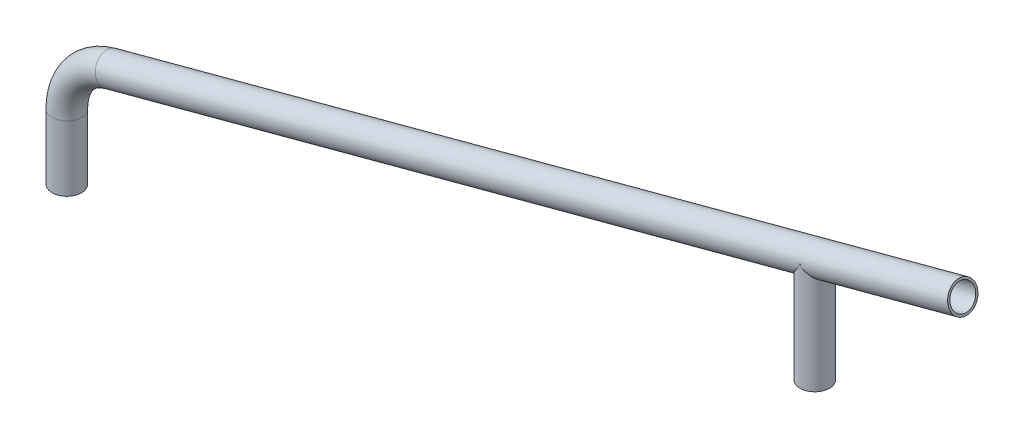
ISO-10303-21;
HEADER;
FILE_DESCRIPTION(('STEP AP214'),'2;1');
FILE_NAME('part.step','',(''),(''),'','','');
FILE_SCHEMA(('AUTOMOTIVE_DESIGN { 1 0 10303 214 1 1 1 1 }'));
ENDSEC;
DATA;
#1=APPLICATION_CONTEXT('core data for automotive mechanical design processes');
#2=APPLICATION_PROTOCOL_DEFINITION('international standard','automotive_design',2000,#1);
#3=PRODUCT_CONTEXT('',#1,'mechanical');
#4=PRODUCT('Part','Part','',(#3));
#5=PRODUCT_RELATED_PRODUCT_CATEGORY('part','',(#4));
#6=PRODUCT_DEFINITION_FORMATION('','',#4);
#7=PRODUCT_DEFINITION_CONTEXT('part definition',#1,'design');
#8=PRODUCT_DEFINITION('design','',#6,#7);
#9=PRODUCT_DEFINITION_SHAPE('','',#8);
#10=(LENGTH_UNIT() NAMED_UNIT(*) SI_UNIT(.MILLI.,.METRE.));
#11=(NAMED_UNIT(*) PLANE_ANGLE_UNIT() SI_UNIT($,.RADIAN.));
#12=(NAMED_UNIT(*) SI_UNIT($,.STERADIAN.) SOLID_ANGLE_UNIT());
#13=UNCERTAINTY_MEASURE_WITH_UNIT(LENGTH_MEASURE(1.E-05),#10,'distance_accuracy_value','');
#14=(GEOMETRIC_REPRESENTATION_CONTEXT(3) GLOBAL_UNCERTAINTY_ASSIGNED_CONTEXT((#13)) GLOBAL_UNIT_ASSIGNED_CONTEXT((#10,
#11,#12)) REPRESENTATION_CONTEXT('',''));
#15=CARTESIAN_POINT('',(0.,0.,0.));
#16=DIRECTION('',(0.,0.,1.));
#17=DIRECTION('',(1.,0.,0.));
#18=AXIS2_PLACEMENT_3D('',#15,#16,#17);
#19=CARTESIAN_POINT('',(29.6472381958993,82.9439535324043,0.));
#20=DIRECTION('',(0.965925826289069,0.258819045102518,0.));
#21=DIRECTION('',(-0.258819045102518,0.965925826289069,0.));
#22=AXIS2_PLACEMENT_3D('',#19,#20,#21);
#23=CYLINDRICAL_SURFACE('',#22,10.);
#24=CARTESIAN_POINT('',(29.6472381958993,82.9439535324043,0.));
#25=DIRECTION('',(0.965925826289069,0.258819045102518,0.));
#26=DIRECTION('',(0.,0.,1.));
#27=AXIS2_PLACEMENT_3D('',#24,#25,#26);
#28=CIRCLE('',#27,10.);
#29=CARTESIAN_POINT('',(27.0590477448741,92.6032117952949,0.));
#30=VERTEX_POINT('',#29);
#31=EDGE_CURVE('E283',#30,#30,#28,.T.);
#32=ORIENTED_EDGE('',*,*,#31,.T.);
#33=EDGE_LOOP('',(#32));
#34=FACE_BOUND('',#33,.T.);
#35=CARTESIAN_POINT('',(608.533270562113,238.055998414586,0.));
#36=DIRECTION('',(0.965925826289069,0.258819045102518,0.));
#37=DIRECTION('',(0.,0.,1.));
#38=AXIS2_PLACEMENT_3D('',#35,#36,#37);
#39=CIRCLE('',#38,10.);
#40=CARTESIAN_POINT('',(608.533270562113,238.055998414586,10.));
#41=VERTEX_POINT('',#40);
#42=EDGE_CURVE('E288',#41,#41,#39,.T.);
#43=ORIENTED_EDGE('',*,*,#42,.F.);
#44=EDGE_LOOP('',(#43));
#45=FACE_BOUND('',#44,.T.);
#46=CARTESIAN_POINT('',(507.995718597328,211.11704255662,0.));
#47=DIRECTION('',(0.608761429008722,0.793353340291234,0.));
#48=DIRECTION('',(0.793353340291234,-0.608761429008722,0.));
#49=AXIS2_PLACEMENT_3D('',#46,#47,#48);
#50=ELLIPSE('',#49,12.6047241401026,9.99999999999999);
#51=CARTESIAN_POINT('',(506.845026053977,212.,-9.93357471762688));
#52=VERTEX_POINT('',#51);
#53=CARTESIAN_POINT('',(507.995718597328,211.11704255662,-10.));
#54=VERTEX_POINT('',#53);
#55=EDGE_CURVE('E225',#52,#54,#50,.F.);
#56=ORIENTED_EDGE('',*,*,#55,.T.);
#57=CARTESIAN_POINT('',(507.995718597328,211.11704255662,0.));
#58=DIRECTION('',(0.793353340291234,-0.608761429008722,0.));
#59=DIRECTION('',(0.608761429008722,0.793353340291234,0.));
#60=AXIS2_PLACEMENT_3D('',#57,#58,#59);
#61=ELLIPSE('',#60,16.4267963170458,9.99999999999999);
#62=CARTESIAN_POINT('',(507.995718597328,211.11704255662,9.99999999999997));
#63=VERTEX_POINT('',#62);
#64=EDGE_CURVE('E265',#54,#63,#61,.F.);
#65=ORIENTED_EDGE('',*,*,#64,.T.);
#66=CARTESIAN_POINT('',(506.845026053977,212.,9.93357471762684));
#67=VERTEX_POINT('',#66);
#68=EDGE_CURVE('E49',#63,#67,#50,.F.);
#69=ORIENTED_EDGE('',*,*,#68,.T.);
#70=CARTESIAN_POINT('',(511.290960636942,212.,0.));
#71=DIRECTION('',(0.,1.,0.));
#72=DIRECTION('',(1.,0.,0.));
#73=AXIS2_PLACEMENT_3D('',#70,#71,#72);
#74=ELLIPSE('',#73,38.6370330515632,10.);
#75=CARTESIAN_POINT('',(508.67323567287,212.,9.97702213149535));
#76=VERTEX_POINT('',#75);
#77=EDGE_CURVE('E262',#76,#67,#74,.F.);
#78=ORIENTED_EDGE('',*,*,#77,.F.);
#79=CARTESIAN_POINT('',(507.995718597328,211.11704255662,0.));
#80=DIRECTION('',(0.793353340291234,-0.608761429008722,0.));
#81=DIRECTION('',(0.608761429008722,0.793353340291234,0.));
#82=AXIS2_PLACEMENT_3D('',#79,#80,#81);
#83=ELLIPSE('',#82,16.4267963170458,9.99999999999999);
#84=EDGE_CURVE('E267',#76,#63,#83,.T.);
#85=ORIENTED_EDGE('',*,*,#84,.T.);
#86=CARTESIAN_POINT('',(507.995718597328,211.11704255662,0.));
#87=DIRECTION('',(0.608761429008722,0.793353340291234,0.));
#88=DIRECTION('',(0.793353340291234,-0.608761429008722,0.));
#89=AXIS2_PLACEMENT_3D('',#86,#87,#88);
#90=ELLIPSE('',#89,12.6047241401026,9.99999999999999);
#91=EDGE_CURVE('E440',#63,#54,#90,.T.);
#92=ORIENTED_EDGE('',*,*,#91,.T.);
#93=CARTESIAN_POINT('',(508.67323567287,212.,-9.97702213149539));
#94=VERTEX_POINT('',#93);
#95=EDGE_CURVE('E261',#54,#94,#83,.T.);
#96=ORIENTED_EDGE('',*,*,#95,.T.);
#97=EDGE_CURVE('E254',#52,#94,#74,.F.);
#98=ORIENTED_EDGE('',*,*,#97,.F.);
#99=EDGE_LOOP('',(#56,#65,#69,#78,#85,#92,#96,#98));
#100=FACE_BOUND('',#99,.T.);
#101=ADVANCED_FACE('F32',(#34,#45,#100),#23,.T.);
#102=CARTESIAN_POINT('',(29.6472381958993,82.9439535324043,0.));
#103=DIRECTION('',(0.965925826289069,0.258819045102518,0.));
#104=DIRECTION('',(-0.258819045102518,0.965925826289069,0.));
#105=AXIS2_PLACEMENT_3D('',#102,#103,#104);
#106=CYLINDRICAL_SURFACE('',#105,8.50000000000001);
#107=CARTESIAN_POINT('',(507.995718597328,211.11704255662,0.));
#108=DIRECTION('',(0.608761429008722,0.793353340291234,0.));
#109=DIRECTION('',(0.793353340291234,-0.608761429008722,0.));
#110=AXIS2_PLACEMENT_3D('',#107,#108,#109);
#111=ELLIPSE('',#110,10.7140155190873,8.50000000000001);
#112=CARTESIAN_POINT('',(506.845026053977,212.,-8.42175199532));
#113=VERTEX_POINT('',#112);
#114=CARTESIAN_POINT('',(507.995718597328,211.11704255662,-8.50000000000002));
#115=VERTEX_POINT('',#114);
#116=EDGE_CURVE('E57',#113,#115,#111,.F.);
#117=ORIENTED_EDGE('',*,*,#116,.T.);
#118=CARTESIAN_POINT('',(507.995718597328,211.11704255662,0.));
#119=DIRECTION('',(0.793353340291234,-0.608761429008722,0.));
#120=DIRECTION('',(0.608761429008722,0.793353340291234,0.));
#121=AXIS2_PLACEMENT_3D('',#118,#119,#120);
#122=ELLIPSE('',#121,13.9627768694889,8.50000000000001);
#123=CARTESIAN_POINT('',(508.67323567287,212.,-8.47295524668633));
#124=VERTEX_POINT('',#123);
#125=EDGE_CURVE('E114',#115,#124,#122,.T.);
#126=ORIENTED_EDGE('',*,*,#125,.T.);
#127=CARTESIAN_POINT('',(511.290960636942,212.,0.));
#128=DIRECTION('',(0.,1.,0.));
#129=DIRECTION('',(1.,0.,0.));
#130=AXIS2_PLACEMENT_3D('',#127,#128,#129);
#131=ELLIPSE('',#130,32.8414780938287,8.50000000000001);
#132=CARTESIAN_POINT('',(513.288863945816,212.,-8.48425673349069));
#133=VERTEX_POINT('',#132);
#134=EDGE_CURVE('E121',#124,#133,#131,.F.);
#135=ORIENTED_EDGE('',*,*,#134,.T.);
#136=CARTESIAN_POINT('',(513.288863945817,212.,8.48425673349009));
#137=CARTESIAN_POINT('',(513.302468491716,211.858403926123,8.47574168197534));
#138=CARTESIAN_POINT('',(513.321866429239,211.717625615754,8.46362143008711));
#139=CARTESIAN_POINT('',(513.371421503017,211.439011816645,8.43224760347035));
#140=CARTESIAN_POINT('',(513.401561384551,211.301171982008,8.41300546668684));
#141=CARTESIAN_POINT('',(513.471336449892,211.031159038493,8.36775184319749));
#142=CARTESIAN_POINT('',(513.510834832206,210.898933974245,8.34183745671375));
#143=CARTESIAN_POINT('',(513.598300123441,210.638796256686,8.28334815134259));
#144=CARTESIAN_POINT('',(513.646270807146,210.510885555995,8.25077026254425));
#145=CARTESIAN_POINT('',(513.766734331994,210.217340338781,8.16715360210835));
#146=CARTESIAN_POINT('',(513.842034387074,210.053573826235,8.113597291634));
#147=CARTESIAN_POINT('',(514.002093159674,209.734749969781,7.99583260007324));
#148=CARTESIAN_POINT('',(514.086855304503,209.579695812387,7.93162035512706));
#149=CARTESIAN_POINT('',(514.263545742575,209.277086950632,7.79275603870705));
#150=CARTESIAN_POINT('',(514.355517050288,209.129587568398,7.71803879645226));
#151=CARTESIAN_POINT('',(514.543756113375,208.842713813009,7.55899529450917));
#152=CARTESIAN_POINT('',(514.640025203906,208.703341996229,7.47466603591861));
#153=CARTESIAN_POINT('',(514.874487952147,208.37719345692,7.26064051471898));
#154=CARTESIAN_POINT('',(515.013816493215,208.194176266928,7.12643715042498));
#155=CARTESIAN_POINT('',(515.292705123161,207.842433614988,6.84060828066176));
#156=CARTESIAN_POINT('',(515.43226527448,207.6737130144,6.6889768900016));
#157=CARTESIAN_POINT('',(515.70803291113,207.350289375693,6.36904787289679));
#158=CARTESIAN_POINT('',(515.84424333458,207.195573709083,6.20076555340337));
#159=CARTESIAN_POINT('',(516.110513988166,206.899995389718,5.84798585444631));
#160=CARTESIAN_POINT('',(516.240574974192,206.759131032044,5.66349047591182));
#161=CARTESIAN_POINT('',(516.492845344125,206.490663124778,5.27753340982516));
#162=CARTESIAN_POINT('',(516.614993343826,206.363159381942,5.07596192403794));
#163=CARTESIAN_POINT('',(516.847963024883,206.123240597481,4.65779468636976));
#164=CARTESIAN_POINT('',(516.958784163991,206.010826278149,4.44119821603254));
#165=CARTESIAN_POINT('',(517.166664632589,205.802110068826,3.99429959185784));
#166=CARTESIAN_POINT('',(517.263735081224,205.705795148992,3.76400872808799));
#167=CARTESIAN_POINT('',(517.442013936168,205.530245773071,3.29109814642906));
#168=CARTESIAN_POINT('',(517.523224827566,205.451008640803,3.04848036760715));
#169=CARTESIAN_POINT('',(517.660738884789,205.317561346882,2.57713600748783));
#170=CARTESIAN_POINT('',(517.71870118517,205.261661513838,2.3493712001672));
#171=CARTESIAN_POINT('',(517.818877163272,205.165375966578,1.88717999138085));
#172=CARTESIAN_POINT('',(517.861091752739,205.124989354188,1.65275397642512));
#173=CARTESIAN_POINT('',(517.928790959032,205.060347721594,1.17948103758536));
#174=CARTESIAN_POINT('',(517.954288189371,205.036080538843,0.940637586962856));
#175=CARTESIAN_POINT('',(517.987998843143,205.004015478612,0.460644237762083));
#176=CARTESIAN_POINT('',(517.996214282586,204.996215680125,0.219494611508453));
#177=CARTESIAN_POINT('',(517.995244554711,204.997137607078,-0.230968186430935));
#178=CARTESIAN_POINT('',(517.988206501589,205.003820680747,-0.440295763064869));
#179=CARTESIAN_POINT('',(517.961090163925,205.029608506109,-0.8573349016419));
#180=CARTESIAN_POINT('',(517.941012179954,205.048712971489,-1.06504650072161));
#181=CARTESIAN_POINT('',(517.888175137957,205.099113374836,-1.47732838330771));
#182=CARTESIAN_POINT('',(517.855416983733,205.130408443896,-1.68189888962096));
#183=CARTESIAN_POINT('',(517.777784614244,205.204836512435,-2.08653462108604));
#184=CARTESIAN_POINT('',(517.732910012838,205.247969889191,-2.28659970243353));
#185=CARTESIAN_POINT('',(517.632269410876,205.345158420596,-2.67909417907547));
#186=CARTESIAN_POINT('',(517.576611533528,205.399105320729,-2.87157825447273));
#187=CARTESIAN_POINT('',(517.454966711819,205.517702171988,-3.24994351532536));
#188=CARTESIAN_POINT('',(517.388975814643,205.582356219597,-3.43582214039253));
#189=CARTESIAN_POINT('',(517.247661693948,205.721812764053,-3.79995737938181));
#190=CARTESIAN_POINT('',(517.172342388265,205.796611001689,-3.97821715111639));
#191=CARTESIAN_POINT('',(517.013365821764,205.955887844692,-4.32651055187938));
#192=CARTESIAN_POINT('',(516.929707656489,206.040367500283,-4.49654328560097));
#193=CARTESIAN_POINT('',(516.745897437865,206.22797965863,-4.84532998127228));
#194=CARTESIAN_POINT('',(516.644936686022,206.332139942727,-5.02310527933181));
#195=CARTESIAN_POINT('',(516.435656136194,206.551244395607,-5.36731145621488));
#196=CARTESIAN_POINT('',(516.327335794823,206.666189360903,-5.53374149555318));
#197=CARTESIAN_POINT('',(516.104687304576,206.906784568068,-5.85516254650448));
#198=CARTESIAN_POINT('',(515.990346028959,207.032458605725,-6.01012662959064));
#199=CARTESIAN_POINT('',(515.757617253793,207.294126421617,-6.30782310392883));
#200=CARTESIAN_POINT('',(515.63922950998,207.430120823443,-6.45055475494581));
#201=CARTESIAN_POINT('',(515.38271084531,207.733314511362,-6.74356063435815));
#202=CARTESIAN_POINT('',(515.244242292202,207.9021584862,-6.89184479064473));
#203=CARTESIAN_POINT('',(514.96786856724,208.254098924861,-7.17131419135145));
#204=CARTESIAN_POINT('',(514.829963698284,208.437202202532,-7.30249117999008));
#205=CARTESIAN_POINT('',(514.5594927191,208.81800358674,-7.54651825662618));
#206=CARTESIAN_POINT('',(514.426912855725,209.01565978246,-7.65941819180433));
#207=CARTESIAN_POINT('',(514.172444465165,209.427118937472,-7.86605604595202));
#208=CARTESIAN_POINT('',(514.050543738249,209.640902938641,-7.95981599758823));
#209=CARTESIAN_POINT('',(513.876039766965,209.984653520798,-8.08874269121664));
#210=CARTESIAN_POINT('',(513.817071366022,210.108688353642,-8.13120441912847));
#211=CARTESIAN_POINT('',(513.706001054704,210.361774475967,-8.20958469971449));
#212=CARTESIAN_POINT('',(513.653896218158,210.490823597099,-8.24550604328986));
#213=CARTESIAN_POINT('',(513.558179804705,210.753236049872,-8.31037702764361));
#214=CARTESIAN_POINT('',(513.51454014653,210.886583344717,-8.33934979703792));
#215=CARTESIAN_POINT('',(513.436938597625,211.157340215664,-8.39018962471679));
#216=CARTESIAN_POINT('',(513.40297103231,211.294747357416,-8.41206085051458));
#217=CARTESIAN_POINT('',(513.355195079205,211.526861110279,-8.44254298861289));
#218=CARTESIAN_POINT('',(513.338432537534,211.620710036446,-8.45314838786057));
#219=CARTESIAN_POINT('',(513.309871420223,211.809584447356,-8.47112975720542));
#220=CARTESIAN_POINT('',(513.29807894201,211.904611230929,-8.47850176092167));
#221=CARTESIAN_POINT('',(513.288863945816,212.,-8.48425673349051));
#222=B_SPLINE_CURVE_WITH_KNOTS('',3,(#136,#137,#138,#139,#140,#141,#142,#143,#144,#145,#146,
#147,#148,#149,#150,#151,#152,#153,#154,#155,#156,#157,#158,#159,#160,#161,#162,#163,#164,#165,
#166,#167,#168,#169,#170,#171,#172,#173,#174,#175,#176,#177,#178,#179,#180,#181,#182,#183,#184,
#185,#186,#187,#188,#189,#190,#191,#192,#193,#194,#195,#196,#197,#198,#199,#200,#201,#202,#203,
#204,#205,#206,#207,#208,#209,#210,#211,#212,#213,#214,#215,#216,#217,#218,#219,#220,#221),
.UNSPECIFIED.,.F.,.F.,(4,2,2,2,2,2,2,2,2,2,2,2,2,2,2,2,2,2,2,2,2,2,2,2,2,2,2,2,2,2,2,2,2,2,2,2,
2,2,2,2,2,2,4),(0.,0.427282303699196,0.853881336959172,1.27459220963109,1.69549100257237,
2.25870213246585,2.82211793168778,3.38919739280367,3.95645426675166,4.75429687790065,
5.55240970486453,6.34979553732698,7.14708309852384,7.94995579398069,8.75286690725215,
9.55512501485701,10.3572573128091,11.0809474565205,11.8045956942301,12.5276972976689,
13.2507145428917,13.8786076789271,14.5064863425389,15.1343202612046,15.7621741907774,
16.3840311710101,17.0061266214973,17.6279616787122,18.2498642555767,18.9375204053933,
19.6252273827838,20.3145013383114,21.0038169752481,21.7947527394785,22.5860688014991,
23.3751889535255,24.1633955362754,24.5943248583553,25.0250698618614,25.4543605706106,
25.8833988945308,26.1709868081,26.4589265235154),.UNSPECIFIED.);
#223=CARTESIAN_POINT('',(513.288863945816,212.,8.48425673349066));
#224=VERTEX_POINT('',#223);
#225=EDGE_CURVE('E128',#224,#133,#222,.T.);
#226=ORIENTED_EDGE('',*,*,#225,.F.);
#227=CARTESIAN_POINT('',(508.67323567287,212.,8.47295524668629));
#228=VERTEX_POINT('',#227);
#229=EDGE_CURVE('E118',#224,#228,#131,.F.);
#230=ORIENTED_EDGE('',*,*,#229,.T.);
#231=CARTESIAN_POINT('',(507.995718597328,211.11704255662,8.49999999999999));
#232=VERTEX_POINT('',#231);
#233=EDGE_CURVE('E101',#228,#232,#122,.T.);
#234=ORIENTED_EDGE('',*,*,#233,.T.);
#235=CARTESIAN_POINT('',(506.845026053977,212.,8.42175199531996));
#236=VERTEX_POINT('',#235);
#237=EDGE_CURVE('E134',#232,#236,#111,.F.);
#238=ORIENTED_EDGE('',*,*,#237,.T.);
#239=CARTESIAN_POINT('',(502.229397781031,212.,8.17003942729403));
#240=VERTEX_POINT('',#239);
#241=EDGE_CURVE('E132',#236,#240,#131,.F.);
#242=ORIENTED_EDGE('',*,*,#241,.T.);
#243=CARTESIAN_POINT('',(502.22939778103,212.,-8.17003942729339));
#244=CARTESIAN_POINT('',(502.288975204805,211.864449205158,-8.21208459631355));
#245=CARTESIAN_POINT('',(502.34458119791,211.725854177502,-8.25035622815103));
#246=CARTESIAN_POINT('',(502.44618439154,211.443118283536,-8.31904194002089));
#247=CARTESIAN_POINT('',(502.492169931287,211.298970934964,-8.34944649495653));
#248=CARTESIAN_POINT('',(502.572207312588,211.007847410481,-8.40165379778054));
#249=CARTESIAN_POINT('',(502.606402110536,210.860929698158,-8.42356002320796));
#250=CARTESIAN_POINT('',(502.662441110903,210.563862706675,-8.45915239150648));
#251=CARTESIAN_POINT('',(502.684292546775,210.413715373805,-8.47284334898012));
#252=CARTESIAN_POINT('',(502.715268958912,210.110608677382,-8.49218448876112));
#253=CARTESIAN_POINT('',(502.724310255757,209.957637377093,-8.49778180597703));
#254=CARTESIAN_POINT('',(502.72972971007,209.651400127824,-8.50113756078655));
#255=CARTESIAN_POINT('',(502.726104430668,209.498134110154,-8.49889387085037));
#256=CARTESIAN_POINT('',(502.697595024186,209.039498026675,-8.481189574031));
#257=CARTESIAN_POINT('',(502.655054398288,208.735543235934,-8.45474145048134));
#258=CARTESIAN_POINT('',(502.550386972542,208.21560827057,-8.38754941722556));
#259=CARTESIAN_POINT('',(502.496119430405,207.997120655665,-8.35223705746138));
#260=CARTESIAN_POINT('',(502.372991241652,207.566433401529,-8.26985224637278));
#261=CARTESIAN_POINT('',(502.304121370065,207.354237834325,-8.22277235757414));
#262=CARTESIAN_POINT('',(502.155325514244,206.935440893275,-8.11776617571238));
#263=CARTESIAN_POINT('',(502.075349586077,206.728870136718,-8.05979044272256));
#264=CARTESIAN_POINT('',(501.907631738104,206.322084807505,-7.93386416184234));
#265=CARTESIAN_POINT('',(501.819890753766,206.121869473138,-7.86591481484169));
#266=CARTESIAN_POINT('',(501.65371274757,205.75967474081,-7.73229645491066));
#267=CARTESIAN_POINT('',(501.576092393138,205.596785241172,-7.66806317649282));
#268=CARTESIAN_POINT('',(501.418096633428,205.275133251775,-7.53297429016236));
#269=CARTESIAN_POINT('',(501.337720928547,205.116371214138,-7.4621179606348));
#270=CARTESIAN_POINT('',(501.093754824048,204.64601199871,-7.23956630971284));
#271=CARTESIAN_POINT('',(500.927387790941,204.340474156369,-7.07793728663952));
#272=CARTESIAN_POINT('',(500.59355528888,203.746898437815,-6.72803243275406));
#273=CARTESIAN_POINT('',(500.426093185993,203.458822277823,-6.53981814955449));
#274=CARTESIAN_POINT('',(500.094570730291,202.901302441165,-6.13516406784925));
#275=CARTESIAN_POINT('',(499.930507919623,202.631844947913,-5.9187455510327));
#276=CARTESIAN_POINT('',(499.67066817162,202.211963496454,-5.54295372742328));
#277=CARTESIAN_POINT('',(499.572407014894,202.054872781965,-5.3927215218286));
#278=CARTESIAN_POINT('',(499.380291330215,201.750322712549,-5.08016625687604));
#279=CARTESIAN_POINT('',(499.286437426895,201.602864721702,-4.91784149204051));
#280=CARTESIAN_POINT('',(499.013795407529,201.17744429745,-4.41262795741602));
#281=CARTESIAN_POINT('',(498.843441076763,200.915658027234,-4.05081941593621));
#282=CARTESIAN_POINT('',(498.572170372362,200.502276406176,-3.36181778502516));
#283=CARTESIAN_POINT('',(498.464219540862,200.339106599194,-3.04444603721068));
#284=CARTESIAN_POINT('',(498.324213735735,200.128406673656,-2.54787351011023));
#285=CARTESIAN_POINT('',(498.281191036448,200.063838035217,-2.37888821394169));
#286=CARTESIAN_POINT('',(498.203352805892,199.947230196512,-2.03485303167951));
#287=CARTESIAN_POINT('',(498.168533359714,199.895185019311,-1.85980608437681));
#288=CARTESIAN_POINT('',(498.107628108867,199.804266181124,-1.50291695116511));
#289=CARTESIAN_POINT('',(498.081632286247,199.765528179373,-1.32102461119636));
#290=CARTESIAN_POINT('',(498.039568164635,199.702894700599,-0.953550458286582));
#291=CARTESIAN_POINT('',(498.023499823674,199.678999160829,-0.767968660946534));
#292=CARTESIAN_POINT('',(498.00177695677,199.646703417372,-0.394975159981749));
#293=CARTESIAN_POINT('',(497.996115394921,199.638292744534,-0.207564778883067));
#294=CARTESIAN_POINT('',(497.995362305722,199.63717364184,0.167312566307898));
#295=CARTESIAN_POINT('',(498.000269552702,199.644463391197,0.354779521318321));
#296=CARTESIAN_POINT('',(498.019026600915,199.672348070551,0.700827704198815));
#297=CARTESIAN_POINT('',(498.031477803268,199.690862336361,0.859658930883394));
#298=CARTESIAN_POINT('',(498.063720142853,199.738850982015,1.17495743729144));
#299=CARTESIAN_POINT('',(498.08351390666,199.768329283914,1.33142385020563));
#300=CARTESIAN_POINT('',(498.130034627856,199.837702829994,1.64096915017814));
#301=CARTESIAN_POINT('',(498.156761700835,199.877598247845,1.79404798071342));
#302=CARTESIAN_POINT('',(498.216644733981,199.96713686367,2.09605087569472));
#303=CARTESIAN_POINT('',(498.249802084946,200.016782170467,2.24497403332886));
#304=CARTESIAN_POINT('',(498.332957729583,200.141545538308,2.5825857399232));
#305=CARTESIAN_POINT('',(498.385012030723,200.219820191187,2.76960974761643));
#306=CARTESIAN_POINT('',(498.497776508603,200.389969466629,3.13458762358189));
#307=CARTESIAN_POINT('',(498.558488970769,200.481847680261,3.31253908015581));
#308=CARTESIAN_POINT('',(498.751874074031,200.775716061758,3.83250246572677));
#309=CARTESIAN_POINT('',(498.8957177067,200.995825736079,4.16032597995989));
#310=CARTESIAN_POINT('',(499.160375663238,201.405738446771,4.69024403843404));
#311=CARTESIAN_POINT('',(499.27636881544,201.586783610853,4.90184933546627));
#312=CARTESIAN_POINT('',(499.516051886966,201.964939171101,5.30568864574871));
#313=CARTESIAN_POINT('',(499.639745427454,202.162057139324,5.49791343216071));
#314=CARTESIAN_POINT('',(499.89242335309,202.570242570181,5.8639738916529));
#315=CARTESIAN_POINT('',(500.021417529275,202.781336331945,6.0377731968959));
#316=CARTESIAN_POINT('',(500.282094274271,203.21541532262,6.3674272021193));
#317=CARTESIAN_POINT('',(500.413776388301,203.438398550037,6.52328490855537));
#318=CARTESIAN_POINT('',(500.683648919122,203.905812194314,6.82469221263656));
#319=CARTESIAN_POINT('',(500.821857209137,204.1507577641,6.96942533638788));
#320=CARTESIAN_POINT('',(501.095811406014,204.651921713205,7.24074841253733));
#321=CARTESIAN_POINT('',(501.231556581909,204.908143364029,7.36733305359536));
#322=CARTESIAN_POINT('',(501.496842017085,205.431354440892,7.60236324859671));
#323=CARTESIAN_POINT('',(501.626391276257,205.698327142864,7.71083572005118));
#324=CARTESIAN_POINT('',(501.874781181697,206.243639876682,7.90944874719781));
#325=CARTESIAN_POINT('',(501.993628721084,206.521972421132,7.99960115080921));
#326=CARTESIAN_POINT('',(502.218451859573,207.101861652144,8.16352911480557));
#327=CARTESIAN_POINT('',(502.323770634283,207.403898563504,8.23655633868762));
#328=CARTESIAN_POINT('',(502.459789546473,207.866701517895,8.3280562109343));
#329=CARTESIAN_POINT('',(502.501445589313,208.022469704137,8.3555350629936));
#330=CARTESIAN_POINT('',(502.575787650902,208.337107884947,8.40394440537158));
#331=CARTESIAN_POINT('',(502.60847424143,208.495977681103,8.4248753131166));
#332=CARTESIAN_POINT('',(502.682241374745,208.929723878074,8.47172916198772));
#333=CARTESIAN_POINT('',(502.712982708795,209.207391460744,8.49076121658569));
#334=CARTESIAN_POINT('',(502.729011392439,209.625272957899,8.50069123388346));
#335=CARTESIAN_POINT('',(502.729338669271,209.764813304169,8.50089715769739));
#336=CARTESIAN_POINT('',(502.719398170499,210.043355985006,8.49473372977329));
#337=CARTESIAN_POINT('',(502.709134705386,210.182358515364,8.48836705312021));
#338=CARTESIAN_POINT('',(502.676945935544,210.46679390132,8.46823676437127));
#339=CARTESIAN_POINT('',(502.654370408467,210.612124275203,8.45406023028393));
#340=CARTESIAN_POINT('',(502.597699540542,210.899623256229,8.41798739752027));
#341=CARTESIAN_POINT('',(502.563597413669,211.041789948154,8.39608655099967));
#342=CARTESIAN_POINT('',(502.484645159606,211.323077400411,8.34447770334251));
#343=CARTESIAN_POINT('',(502.439698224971,211.462157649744,8.31469913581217));
#344=CARTESIAN_POINT('',(502.340861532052,211.735099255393,8.24779545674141));
#345=CARTESIAN_POINT('',(502.286982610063,211.868966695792,8.21067923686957));
#346=CARTESIAN_POINT('',(502.229397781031,212.,8.17003942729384));
#347=B_SPLINE_CURVE_WITH_KNOTS('',3,(#243,#244,#245,#246,#247,#248,#249,#250,#251,#252,#253,
#254,#255,#256,#257,#258,#259,#260,#261,#262,#263,#264,#265,#266,#267,#268,#269,#270,#271,#272,
#273,#274,#275,#276,#277,#278,#279,#280,#281,#282,#283,#284,#285,#286,#287,#288,#289,#290,#291,
#292,#293,#294,#295,#296,#297,#298,#299,#300,#301,#302,#303,#304,#305,#306,#307,#308,#309,#310,
#311,#312,#313,#314,#315,#316,#317,#318,#319,#320,#321,#322,#323,#324,#325,#326,#327,#328,#329,
#330,#331,#332,#333,#334,#335,#336,#337,#338,#339,#340,#341,#342,#343,#344,#345,#346),
.UNSPECIFIED.,.F.,.F.,(4,2,2,2,2,2,2,2,2,2,2,2,2,2,2,2,2,2,2,2,2,2,2,2,2,2,2,2,2,2,2,2,2,2,2,2,
2,2,2,2,2,2,2,2,2,2,2,2,2,2,2,4),(0.,0.461805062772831,0.924166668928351,1.38070713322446,
1.83697977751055,2.29621939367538,2.75558362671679,3.67506435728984,4.35788720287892,
5.04114271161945,5.72757681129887,6.41392832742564,6.98833263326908,7.56279959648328,
8.71219513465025,9.85897203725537,11.0048885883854,11.720008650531,12.4352297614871,
13.8622757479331,14.9762298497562,15.5334679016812,16.0904394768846,16.6529313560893,
17.2154208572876,17.7775299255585,18.3395738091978,18.8201889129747,19.3009761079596,
19.7817713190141,20.2626706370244,20.8896717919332,21.5168387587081,22.772143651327,
23.6761370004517,24.5805587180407,25.4867335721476,26.3927563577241,27.3409144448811,
28.2893494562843,29.2363621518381,30.1827604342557,31.1649520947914,31.6552910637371,
32.1455987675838,32.9817150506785,33.3998715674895,33.8178579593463,34.2604216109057,
34.7032462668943,35.1501804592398,35.5965763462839),.UNSPECIFIED.);
#348=CARTESIAN_POINT('',(502.229397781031,212.,-8.17003942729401));
#349=VERTEX_POINT('',#348);
#350=EDGE_CURVE('E130',#349,#240,#347,.T.);
#351=ORIENTED_EDGE('',*,*,#350,.F.);
#352=EDGE_CURVE('E112',#349,#113,#131,.F.);
#353=ORIENTED_EDGE('',*,*,#352,.T.);
#354=EDGE_LOOP('',(#117,#126,#135,#226,#230,#234,#238,#242,#351,#353));
#355=FACE_BOUND('',#354,.T.);
#356=CARTESIAN_POINT('',(29.6472381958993,82.9439535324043,0.));
#357=DIRECTION('',(0.965925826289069,0.258819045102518,0.));
#358=DIRECTION('',(0.,0.,1.));
#359=AXIS2_PLACEMENT_3D('',#356,#357,#358);
#360=CIRCLE('',#359,8.50000000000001);
#361=CARTESIAN_POINT('',(27.4472763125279,91.1543230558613,0.));
#362=VERTEX_POINT('',#361);
#363=EDGE_CURVE('E280',#362,#362,#360,.T.);
#364=ORIENTED_EDGE('',*,*,#363,.F.);
#365=EDGE_LOOP('',(#364));
#366=FACE_BOUND('',#365,.T.);
#367=CARTESIAN_POINT('',(608.533270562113,238.055998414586,0.));
#368=DIRECTION('',(0.965925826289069,0.258819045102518,0.));
#369=DIRECTION('',(0.,0.,1.));
#370=AXIS2_PLACEMENT_3D('',#367,#368,#369);
#371=CIRCLE('',#370,8.50000000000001);
#372=CARTESIAN_POINT('',(608.533270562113,238.055998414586,8.50000000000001));
#373=VERTEX_POINT('',#372);
#374=EDGE_CURVE('E285',#373,#373,#371,.T.);
#375=ORIENTED_EDGE('',*,*,#374,.T.);
#376=EDGE_LOOP('',(#375));
#377=FACE_BOUND('',#376,.T.);
#378=ADVANCED_FACE('F126',(#355,#366,#377),#106,.F.);
#379=CARTESIAN_POINT('',(40.,44.3069204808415,0.));
#380=DIRECTION('',(0.,0.,-1.));
#381=DIRECTION('',(-1.,0.,0.));
#382=AXIS2_PLACEMENT_3D('',#379,#380,#381);
#383=TOROIDAL_SURFACE('',#382,40.,10.);
#384=CARTESIAN_POINT('',(0.,44.3069204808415,0.));
#385=DIRECTION('',(0.,1.,0.));
#386=DIRECTION('',(0.,0.,1.));
#387=AXIS2_PLACEMENT_3D('',#384,#385,#386);
#388=CIRCLE('',#387,10.);
#389=CARTESIAN_POINT('',(-10.,44.3069204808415,0.));
#390=VERTEX_POINT('',#389);
#391=EDGE_CURVE('E278',#390,#390,#388,.T.);
#392=CARTESIAN_POINT('',(40.,44.3069204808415,0.));
#393=DIRECTION('',(0.,0.,-1.));
#394=DIRECTION('',(-1.,0.,0.));
#395=AXIS2_PLACEMENT_3D('',#392,#393,#394);
#396=CIRCLE('',#395,50.);
#397=EDGE_CURVE('',#390,#30,#396,.T.);
#398=ORIENTED_EDGE('',*,*,#391,.T.);
#399=ORIENTED_EDGE('',*,*,#31,.F.);
#400=ORIENTED_EDGE('',*,*,#397,.T.);
#401=ORIENTED_EDGE('',*,*,#397,.F.);
#402=EDGE_LOOP('',(#398,#400,#399,#401));
#403=FACE_BOUND('',#402,.T.);
#404=ADVANCED_FACE('F178',(#403),#383,.T.);
#405=CARTESIAN_POINT('',(40.,44.3069204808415,0.));
#406=DIRECTION('',(0.,0.,-1.));
#407=DIRECTION('',(-1.,0.,0.));
#408=AXIS2_PLACEMENT_3D('',#405,#406,#407);
#409=TOROIDAL_SURFACE('',#408,40.,8.50000000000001);
#410=CARTESIAN_POINT('',(0.,44.3069204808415,0.));
#411=DIRECTION('',(0.,1.,0.));
#412=DIRECTION('',(0.,0.,1.));
#413=AXIS2_PLACEMENT_3D('',#410,#411,#412);
#414=CIRCLE('',#413,8.50000000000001);
#415=CARTESIAN_POINT('',(-8.50000000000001,44.3069204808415,0.));
#416=VERTEX_POINT('',#415);
#417=EDGE_CURVE('E275',#416,#416,#414,.T.);
#418=CARTESIAN_POINT('',(40.,44.3069204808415,0.));
#419=DIRECTION('',(0.,0.,-1.));
#420=DIRECTION('',(-1.,0.,0.));
#421=AXIS2_PLACEMENT_3D('',#418,#419,#420);
#422=CIRCLE('',#421,48.5);
#423=EDGE_CURVE('',#416,#362,#422,.T.);
#424=ORIENTED_EDGE('',*,*,#417,.F.);
#425=ORIENTED_EDGE('',*,*,#363,.T.);
#426=ORIENTED_EDGE('',*,*,#423,.T.);
#427=ORIENTED_EDGE('',*,*,#423,.F.);
#428=EDGE_LOOP('',(#424,#426,#425,#427));
#429=FACE_BOUND('',#428,.T.);
#430=ADVANCED_FACE('F175',(#429),#409,.F.);
#431=CARTESIAN_POINT('',(0.,44.3069204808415,0.));
#432=DIRECTION('',(0.,-1.,0.));
#433=DIRECTION('',(0.,0.,-1.));
#434=AXIS2_PLACEMENT_3D('',#431,#432,#433);
#435=CYLINDRICAL_SURFACE('',#434,8.50000000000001);
#436=ORIENTED_EDGE('',*,*,#417,.T.);
#437=EDGE_LOOP('',(#436));
#438=FACE_BOUND('',#437,.T.);
#439=CARTESIAN_POINT('',(0.,0.,0.));
#440=DIRECTION('',(0.,1.,0.));
#441=DIRECTION('',(0.,0.,1.));
#442=AXIS2_PLACEMENT_3D('',#439,#440,#441);
#443=CIRCLE('',#442,8.50000000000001);
#444=CARTESIAN_POINT('',(0.,0.,8.50000000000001));
#445=VERTEX_POINT('',#444);
#446=EDGE_CURVE('E264',#445,#445,#443,.T.);
#447=ORIENTED_EDGE('',*,*,#446,.F.);
#448=EDGE_LOOP('',(#447));
#449=FACE_BOUND('',#448,.T.);
#450=ADVANCED_FACE('F171',(#438,#449),#435,.F.);
#451=CARTESIAN_POINT('',(0.,44.3069204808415,0.));
#452=DIRECTION('',(0.,-1.,0.));
#453=DIRECTION('',(0.,0.,-1.));
#454=AXIS2_PLACEMENT_3D('',#451,#452,#453);
#455=CYLINDRICAL_SURFACE('',#454,10.);
#456=ORIENTED_EDGE('',*,*,#391,.F.);
#457=EDGE_LOOP('',(#456));
#458=FACE_BOUND('',#457,.T.);
#459=CARTESIAN_POINT('',(0.,0.,0.));
#460=DIRECTION('',(0.,1.,0.));
#461=DIRECTION('',(0.,0.,1.));
#462=AXIS2_PLACEMENT_3D('',#459,#460,#461);
#463=CIRCLE('',#462,10.);
#464=CARTESIAN_POINT('',(0.,0.,10.));
#465=VERTEX_POINT('',#464);
#466=EDGE_CURVE('E272',#465,#465,#463,.T.);
#467=ORIENTED_EDGE('',*,*,#466,.T.);
#468=EDGE_LOOP('',(#467));
#469=FACE_BOUND('',#468,.T.);
#470=ADVANCED_FACE('F167',(#458,#469),#455,.T.);
#471=CARTESIAN_POINT('',(608.533270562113,238.055998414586,0.));
#472=DIRECTION('',(0.965925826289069,0.258819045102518,0.));
#473=DIRECTION('',(0.,0.,1.));
#474=AXIS2_PLACEMENT_3D('',#471,#472,#473);
#475=PLANE('',#474);
#476=ORIENTED_EDGE('',*,*,#374,.F.);
#477=EDGE_LOOP('',(#476));
#478=FACE_BOUND('',#477,.T.);
#479=ORIENTED_EDGE('',*,*,#42,.T.);
#480=EDGE_LOOP('',(#479));
#481=FACE_BOUND('',#480,.T.);
#482=ADVANCED_FACE('F163',(#478,#481),#475,.T.);
#483=CARTESIAN_POINT('',(0.,0.,0.));
#484=DIRECTION('',(0.,1.,0.));
#485=DIRECTION('',(0.,0.,1.));
#486=AXIS2_PLACEMENT_3D('',#483,#484,#485);
#487=PLANE('',#486);
#488=ORIENTED_EDGE('',*,*,#446,.T.);
#489=EDGE_LOOP('',(#488));
#490=FACE_BOUND('',#489,.T.);
#491=ORIENTED_EDGE('',*,*,#466,.F.);
#492=EDGE_LOOP('',(#491));
#493=FACE_BOUND('',#492,.T.);
#494=ADVANCED_FACE('F158',(#490,#493),#487,.F.);
#495=CARTESIAN_POINT('',(507.995718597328,212.,0.));
#496=DIRECTION('',(0.,-1.,0.));
#497=DIRECTION('',(0.,0.,-1.));
#498=AXIS2_PLACEMENT_3D('',#495,#496,#497);
#499=CYLINDRICAL_SURFACE('',#498,9.99999999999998);
#500=CARTESIAN_POINT('',(507.995718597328,212.,0.));
#501=DIRECTION('',(0.,1.,0.));
#502=DIRECTION('',(0.,0.,1.));
#503=AXIS2_PLACEMENT_3D('',#500,#501,#502);
#504=CIRCLE('',#503,9.99999999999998);
#505=EDGE_CURVE('E220',#349,#240,#504,.T.);
#506=ORIENTED_EDGE('',*,*,#505,.F.);
#507=ORIENTED_EDGE('',*,*,#350,.T.);
#508=EDGE_LOOP('',(#506,#507));
#509=FACE_BOUND('',#508,.T.);
#510=ADVANCED_FACE('F162',(#509),#499,.T.);
#511=CARTESIAN_POINT('',(507.995718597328,212.,0.));
#512=DIRECTION('',(0.,-1.,0.));
#513=DIRECTION('',(0.,0.,-1.));
#514=AXIS2_PLACEMENT_3D('',#511,#512,#513);
#515=CYLINDRICAL_SURFACE('',#514,8.50000000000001);
#516=CARTESIAN_POINT('',(507.995718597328,211.11704255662,0.));
#517=DIRECTION('',(0.793353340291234,-0.608761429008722,0.));
#518=DIRECTION('',(0.608761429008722,0.793353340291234,0.));
#519=AXIS2_PLACEMENT_3D('',#516,#517,#518);
#520=ELLIPSE('',#519,13.9627768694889,8.50000000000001);
#521=EDGE_CURVE('E37',#115,#232,#520,.F.);
#522=ORIENTED_EDGE('',*,*,#521,.F.);
#523=ORIENTED_EDGE('',*,*,#116,.F.);
#524=CARTESIAN_POINT('',(507.995718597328,212.,0.));
#525=DIRECTION('',(0.,1.,0.));
#526=DIRECTION('',(0.,0.,1.));
#527=AXIS2_PLACEMENT_3D('',#524,#525,#526);
#528=CIRCLE('',#527,8.50000000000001);
#529=EDGE_CURVE('E123',#113,#236,#528,.T.);
#530=ORIENTED_EDGE('',*,*,#529,.T.);
#531=ORIENTED_EDGE('',*,*,#237,.F.);
#532=EDGE_LOOP('',(#522,#523,#530,#531));
#533=FACE_BOUND('',#532,.T.);
#534=ADVANCED_FACE('F209',(#533),#515,.F.);
#535=CARTESIAN_POINT('',(507.995718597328,212.,0.));
#536=DIRECTION('',(0.,1.,0.));
#537=DIRECTION('',(0.,0.,1.));
#538=AXIS2_PLACEMENT_3D('',#535,#536,#537);
#539=PLANE('',#538);
#540=ORIENTED_EDGE('',*,*,#241,.F.);
#541=ORIENTED_EDGE('',*,*,#529,.F.);
#542=ORIENTED_EDGE('',*,*,#352,.F.);
#543=ORIENTED_EDGE('',*,*,#505,.T.);
#544=EDGE_LOOP('',(#540,#541,#542,#543));
#545=FACE_BOUND('',#544,.T.);
#546=ADVANCED_FACE('F234',(#545),#539,.T.);
#547=CARTESIAN_POINT('',(507.995718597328,211.11704255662,0.));
#548=DIRECTION('',(0.608761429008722,0.793353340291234,0.));
#549=DIRECTION('',(0.793353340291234,-0.608761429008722,0.));
#550=AXIS2_PLACEMENT_3D('',#547,#548,#549);
#551=ELLIPSE('',#550,10.7140155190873,8.50000000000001);
#552=EDGE_CURVE('E107',#232,#115,#551,.T.);
#553=ORIENTED_EDGE('',*,*,#552,.T.);
#554=ORIENTED_EDGE('',*,*,#521,.T.);
#555=EDGE_LOOP('',(#553,#554));
#556=FACE_BOUND('',#555,.T.);
#557=ADVANCED_FACE('F185',(#556),#106,.F.);
#558=ORIENTED_EDGE('',*,*,#125,.F.);
#559=ORIENTED_EDGE('',*,*,#552,.F.);
#560=ORIENTED_EDGE('',*,*,#233,.F.);
#561=EDGE_CURVE('E105',#228,#124,#528,.T.);
#562=ORIENTED_EDGE('',*,*,#561,.T.);
#563=EDGE_LOOP('',(#558,#559,#560,#562));
#564=FACE_BOUND('',#563,.T.);
#565=ADVANCED_FACE('F104',(#564),#515,.F.);
#566=EDGE_CURVE('E221',#224,#133,#504,.T.);
#567=ORIENTED_EDGE('',*,*,#566,.F.);
#568=ORIENTED_EDGE('',*,*,#225,.T.);
#569=EDGE_LOOP('',(#567,#568));
#570=FACE_BOUND('',#569,.T.);
#571=ADVANCED_FACE('F155',(#570),#499,.T.);
#572=ORIENTED_EDGE('',*,*,#229,.F.);
#573=ORIENTED_EDGE('',*,*,#566,.T.);
#574=ORIENTED_EDGE('',*,*,#134,.F.);
#575=ORIENTED_EDGE('',*,*,#561,.F.);
#576=EDGE_LOOP('',(#572,#573,#574,#575));
#577=FACE_BOUND('',#576,.T.);
#578=ADVANCED_FACE('F116',(#577),#539,.T.);
#579=CARTESIAN_POINT('',(507.995718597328,139.,0.));
#580=DIRECTION('',(0.,1.,0.));
#581=DIRECTION('',(0.,0.,1.));
#582=AXIS2_PLACEMENT_3D('',#579,#580,#581);
#583=PLANE('',#582);
#584=CARTESIAN_POINT('',(507.995718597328,139.,0.));
#585=DIRECTION('',(0.,1.,0.));
#586=DIRECTION('',(0.,0.,1.));
#587=AXIS2_PLACEMENT_3D('',#584,#585,#586);
#588=CIRCLE('',#587,8.50000000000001);
#589=CARTESIAN_POINT('',(507.995718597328,139.,8.49999999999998));
#590=VERTEX_POINT('',#589);
#591=EDGE_CURVE('E212',#590,#590,#588,.T.);
#592=ORIENTED_EDGE('',*,*,#591,.T.);
#593=EDGE_LOOP('',(#592));
#594=FACE_BOUND('',#593,.T.);
#595=CARTESIAN_POINT('',(507.995718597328,139.,0.));
#596=DIRECTION('',(0.,1.,0.));
#597=DIRECTION('',(0.,0.,1.));
#598=AXIS2_PLACEMENT_3D('',#595,#596,#597);
#599=CIRCLE('',#598,9.99999999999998);
#600=CARTESIAN_POINT('',(507.995718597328,139.,9.99999999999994));
#601=VERTEX_POINT('',#600);
#602=EDGE_CURVE('E214',#601,#601,#599,.T.);
#603=ORIENTED_EDGE('',*,*,#602,.F.);
#604=EDGE_LOOP('',(#603));
#605=FACE_BOUND('',#604,.T.);
#606=ADVANCED_FACE('F208',(#594,#605),#583,.F.);
#607=CARTESIAN_POINT('',(507.995718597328,205.663386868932,-8.50000000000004));
#608=CARTESIAN_POINT('',(507.820296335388,205.616380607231,-8.49999976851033));
#609=CARTESIAN_POINT('',(507.647152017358,205.560867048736,-8.49455767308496));
#610=CARTESIAN_POINT('',(507.30692423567,205.43520233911,-8.47376228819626));
#611=CARTESIAN_POINT('',(507.139843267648,205.365045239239,-8.45840496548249));
#612=CARTESIAN_POINT('',(506.647083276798,205.136086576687,-8.39887772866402));
#613=CARTESIAN_POINT('',(506.331381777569,204.959239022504,-8.34126970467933));
#614=CARTESIAN_POINT('',(505.780523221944,204.612159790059,-8.21023680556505));
#615=CARTESIAN_POINT('',(505.541126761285,204.446518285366,-8.14155820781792));
#616=CARTESIAN_POINT('',(505.076553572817,204.103490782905,-7.98676275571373));
#617=CARTESIAN_POINT('',(504.851387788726,203.926095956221,-7.90063268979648));
#618=CARTESIAN_POINT('',(504.413293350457,203.564639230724,-7.71188642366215));
#619=CARTESIAN_POINT('',(504.200379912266,203.380569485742,-7.60925030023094));
#620=CARTESIAN_POINT('',(503.785711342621,203.009725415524,-7.3878973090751));
#621=CARTESIAN_POINT('',(503.583952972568,202.822951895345,-7.2691851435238));
#622=CARTESIAN_POINT('',(503.170939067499,202.430753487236,-7.00270304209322));
#623=CARTESIAN_POINT('',(502.960775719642,202.225345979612,-6.85321035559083));
#624=CARTESIAN_POINT('',(502.55269611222,201.818081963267,-6.53380730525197));
#625=CARTESIAN_POINT('',(502.354783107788,201.616226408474,-6.36389154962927));
#626=CARTESIAN_POINT('',(501.972314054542,201.219894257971,-6.00312797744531));
#627=CARTESIAN_POINT('',(501.787727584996,201.025401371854,-5.81233050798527));
#628=CARTESIAN_POINT('',(501.432847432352,200.646903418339,-5.40841275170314));
#629=CARTESIAN_POINT('',(501.262545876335,200.462892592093,-5.19530490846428));
#630=CARTESIAN_POINT('',(500.996354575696,200.172578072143,-4.826034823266));
#631=CARTESIAN_POINT('',(500.895609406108,200.061990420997,-4.67671312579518));
#632=CARTESIAN_POINT('',(500.701717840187,199.84805956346,-4.36815275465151));
#633=CARTESIAN_POINT('',(500.60857305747,199.744717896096,-4.20891198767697));
#634=CARTESIAN_POINT('',(500.430959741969,199.546814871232,-3.88062168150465));
#635=CARTESIAN_POINT('',(500.346484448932,199.452246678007,-3.71157994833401));
#636=CARTESIAN_POINT('',(500.187304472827,199.273421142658,-3.36380766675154));
#637=CARTESIAN_POINT('',(500.112594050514,199.189157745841,-3.18508289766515));
#638=CARTESIAN_POINT('',(499.986177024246,199.046175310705,-2.85017333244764));
#639=CARTESIAN_POINT('',(499.932728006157,198.985560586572,-2.69545511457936));
#640=CARTESIAN_POINT('',(499.834114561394,198.873513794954,-2.38022505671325));
#641=CARTESIAN_POINT('',(499.788946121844,198.822077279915,-2.2197160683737));
#642=CARTESIAN_POINT('',(499.707629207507,198.72934039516,-1.89361981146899));
#643=CARTESIAN_POINT('',(499.671477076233,198.688035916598,-1.72803463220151));
#644=CARTESIAN_POINT('',(499.608853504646,198.616412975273,-1.39268896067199));
#645=CARTESIAN_POINT('',(499.582382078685,198.586094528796,-1.22292846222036));
#646=CARTESIAN_POINT('',(499.539544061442,198.537000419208,-0.879355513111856));
#647=CARTESIAN_POINT('',(499.523242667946,198.518299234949,-0.705524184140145));
#648=CARTESIAN_POINT('',(499.501387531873,198.493221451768,-0.35629519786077));
#649=CARTESIAN_POINT('',(499.495833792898,198.486844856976,-0.180897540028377));
#650=CARTESIAN_POINT('',(499.495606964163,198.48658446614,0.169892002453));
#651=CARTESIAN_POINT('',(499.50093257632,198.49269917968,0.345283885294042));
#652=CARTESIAN_POINT('',(499.522334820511,198.517257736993,0.694530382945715));
#653=CARTESIAN_POINT('',(499.538410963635,198.535701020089,0.868385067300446));
#654=CARTESIAN_POINT('',(499.578851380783,198.582048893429,1.19619971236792));
#655=CARTESIAN_POINT('',(499.602248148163,198.60884814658,1.3504385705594));
#656=CARTESIAN_POINT('',(499.657080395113,198.671577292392,1.65564527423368));
#657=CARTESIAN_POINT('',(499.688518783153,198.707510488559,1.80661191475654));
#658=CARTESIAN_POINT('',(499.758932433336,198.787865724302,2.10446568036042));
#659=CARTESIAN_POINT('',(499.797907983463,198.832288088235,2.25135264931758));
#660=CARTESIAN_POINT('',(499.882848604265,198.928914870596,2.54048396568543));
#661=CARTESIAN_POINT('',(499.928815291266,198.981121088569,2.68272723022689));
#662=CARTESIAN_POINT('',(500.047684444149,199.115821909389,3.02039273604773));
#663=CARTESIAN_POINT('',(500.123828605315,199.201871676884,3.2132708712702));
#664=CARTESIAN_POINT('',(500.287450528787,199.386035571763,3.58810214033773));
#665=CARTESIAN_POINT('',(500.374932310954,199.484153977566,3.77005136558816));
#666=CARTESIAN_POINT('',(500.652498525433,199.793974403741,4.29954005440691));
#667=CARTESIAN_POINT('',(500.857601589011,200.021024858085,4.63044046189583));
#668=CARTESIAN_POINT('',(501.2388627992,200.43720925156,5.16446285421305));
#669=CARTESIAN_POINT('',(501.407882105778,200.620026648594,5.37796115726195));
#670=CARTESIAN_POINT('',(501.760278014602,200.996340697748,5.78284369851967));
#671=CARTESIAN_POINT('',(501.943661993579,201.189842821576,5.9742164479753));
#672=CARTESIAN_POINT('',(502.323988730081,201.584625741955,6.33646315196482));
#673=CARTESIAN_POINT('',(502.520982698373,201.785934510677,6.50725221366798));
#674=CARTESIAN_POINT('',(502.927208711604,202.192269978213,6.82841306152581));
#675=CARTESIAN_POINT('',(503.136437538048,202.397295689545,6.97879018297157));
#676=CARTESIAN_POINT('',(503.577506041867,202.817450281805,7.26649899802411));
#677=CARTESIAN_POINT('',(503.809946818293,203.032599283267,7.40287997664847));
#678=CARTESIAN_POINT('',(504.289846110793,203.459055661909,7.65440898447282));
#679=CARTESIAN_POINT('',(504.537316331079,203.670359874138,7.76954017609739));
#680=CARTESIAN_POINT('',(505.04796508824,204.081828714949,7.97724265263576));
#681=CARTESIAN_POINT('',(505.311049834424,204.282048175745,8.06993442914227));
#682=CARTESIAN_POINT('',(505.857220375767,204.6637328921,8.23150908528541));
#683=CARTESIAN_POINT('',(506.140266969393,204.845233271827,8.30043714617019));
#684=CARTESIAN_POINT('',(506.560444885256,205.081371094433,8.3789169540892));
#685=CARTESIAN_POINT('',(506.688161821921,205.14906757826,8.39985018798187));
#686=CARTESIAN_POINT('',(506.947915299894,205.277341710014,8.43619088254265));
#687=CARTESIAN_POINT('',(507.079951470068,205.337919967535,8.45159881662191));
#688=CARTESIAN_POINT('',(507.347867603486,205.450414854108,8.47633958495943));
#689=CARTESIAN_POINT('',(507.483737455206,205.502352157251,8.48568707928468));
#690=CARTESIAN_POINT('',(507.759130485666,205.596346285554,8.49782386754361));
#691=CARTESIAN_POINT('',(507.898652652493,205.638405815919,8.50061495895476));
#692=CARTESIAN_POINT('',(508.182102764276,205.711908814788,8.49915046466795));
#693=CARTESIAN_POINT('',(508.32606235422,205.743229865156,8.49481668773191));
#694=CARTESIAN_POINT('',(508.615654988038,205.793892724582,8.47860275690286));
#695=CARTESIAN_POINT('',(508.761287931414,205.813235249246,8.46672305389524));
#696=CARTESIAN_POINT('',(509.052971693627,205.839915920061,8.43526849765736));
#697=CARTESIAN_POINT('',(509.199022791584,205.847241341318,8.41568551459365));
#698=CARTESIAN_POINT('',(509.490025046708,205.850491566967,8.36891745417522));
#699=CARTESIAN_POINT('',(509.63497602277,205.846414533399,8.34173115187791));
#700=CARTESIAN_POINT('',(509.944276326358,205.826626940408,8.27537061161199));
#701=CARTESIAN_POINT('',(510.108262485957,205.809258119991,8.23500805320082));
#702=CARTESIAN_POINT('',(510.432036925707,205.763151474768,8.14509733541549));
#703=CARTESIAN_POINT('',(510.591824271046,205.734411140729,8.0955471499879));
#704=CARTESIAN_POINT('',(510.90686386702,205.667744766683,7.98767974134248));
#705=CARTESIAN_POINT('',(511.062103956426,205.629796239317,7.92934119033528));
#706=CARTESIAN_POINT('',(511.367319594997,205.54681817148,7.80445465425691));
#707=CARTESIAN_POINT('',(511.51729327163,205.50178614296,7.73790378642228));
#708=CARTESIAN_POINT('',(511.884546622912,205.382907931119,7.56217596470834));
#709=CARTESIAN_POINT('',(512.098481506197,205.305816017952,7.4481810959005));
#710=CARTESIAN_POINT('',(512.513998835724,205.144728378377,7.20369984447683));
#711=CARTESIAN_POINT('',(512.71557579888,205.06072962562,7.07320621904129));
#712=CARTESIAN_POINT('',(513.106197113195,204.889508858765,6.79634675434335));
#713=CARTESIAN_POINT('',(513.295236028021,204.802285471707,6.64997410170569));
#714=CARTESIAN_POINT('',(513.660242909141,204.627612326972,6.3419383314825));
#715=CARTESIAN_POINT('',(513.836212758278,204.540162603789,6.18027742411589));
#716=CARTESIAN_POINT('',(514.178531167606,204.365383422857,5.83804724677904));
#717=CARTESIAN_POINT('',(514.344546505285,204.27810745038,5.65711670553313));
#718=CARTESIAN_POINT('',(514.661252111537,204.108127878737,5.28026857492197));
#719=CARTESIAN_POINT('',(514.811941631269,204.025424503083,5.08435025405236));
#720=CARTESIAN_POINT('',(515.096689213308,203.866681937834,4.67842194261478));
#721=CARTESIAN_POINT('',(515.230757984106,203.790638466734,4.46842116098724));
#722=CARTESIAN_POINT('',(515.480992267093,203.647024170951,4.03524766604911));
#723=CARTESIAN_POINT('',(515.597159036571,203.579452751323,3.81207587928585));
#724=CARTESIAN_POINT('',(515.806830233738,203.456420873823,3.3610196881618));
#725=CARTESIAN_POINT('',(515.900924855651,203.400650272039,3.13349500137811));
#726=CARTESIAN_POINT('',(516.069609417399,203.30005279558,2.66895763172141));
#727=CARTESIAN_POINT('',(516.144199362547,203.255225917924,2.43194495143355));
#728=CARTESIAN_POINT('',(516.272615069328,203.177730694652,1.95063222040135));
#729=CARTESIAN_POINT('',(516.326458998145,203.145051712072,1.70633874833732));
#730=CARTESIAN_POINT('',(516.412507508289,203.0927043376,1.21261002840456));
#731=CARTESIAN_POINT('',(516.444715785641,203.073033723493,0.963175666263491));
#732=CARTESIAN_POINT('',(516.483832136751,203.049126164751,0.498195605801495));
#733=CARTESIAN_POINT('',(516.493735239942,203.043062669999,0.282989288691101));
#734=CARTESIAN_POINT('',(516.497162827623,203.040965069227,-0.147600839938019));
#735=CARTESIAN_POINT('',(516.490688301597,203.0449303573,-0.362984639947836));
#736=CARTESIAN_POINT('',(516.461456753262,203.062804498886,-0.792172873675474));
#737=CARTESIAN_POINT('',(516.438703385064,203.076711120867,-1.00597765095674));
#738=CARTESIAN_POINT('',(516.377238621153,203.114173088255,-1.43042088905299));
#739=CARTESIAN_POINT('',(516.338527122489,203.137728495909,-1.64105932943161));
#740=CARTESIAN_POINT('',(516.247867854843,203.192670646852,-2.04777210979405));
#741=CARTESIAN_POINT('',(516.196633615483,203.223633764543,-2.24406380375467));
#742=CARTESIAN_POINT('',(516.080717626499,203.29333338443,-2.63128271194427));
#743=CARTESIAN_POINT('',(516.016031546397,203.332072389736,-2.82220817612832));
#744=CARTESIAN_POINT('',(515.873918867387,203.41663461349,-3.19753246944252));
#745=CARTESIAN_POINT('',(515.796497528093,203.462454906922,-3.38193395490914));
#746=CARTESIAN_POINT('',(515.62957377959,203.560458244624,-3.74351829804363));
#747=CARTESIAN_POINT('',(515.540066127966,203.612644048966,-3.92069797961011));
#748=CARTESIAN_POINT('',(515.342056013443,203.726960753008,-4.28099417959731));
#749=CARTESIAN_POINT('',(515.23260493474,203.789553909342,-4.46344258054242));
#750=CARTESIAN_POINT('',(515.001378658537,203.92004794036,-4.81825295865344));
#751=CARTESIAN_POINT('',(514.879606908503,203.987947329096,-4.99061773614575));
#752=CARTESIAN_POINT('',(514.62432853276,204.12796623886,-5.32502045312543));
#753=CARTESIAN_POINT('',(514.490805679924,204.200091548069,-5.4870435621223));
#754=CARTESIAN_POINT('',(514.212901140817,204.347145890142,-5.80003759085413));
#755=CARTESIAN_POINT('',(514.068521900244,204.422074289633,-5.95101098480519));
#756=CARTESIAN_POINT('',(513.747375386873,204.584465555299,-6.26304200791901));
#757=CARTESIAN_POINT('',(513.56897133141,204.672147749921,-6.42230480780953));
#758=CARTESIAN_POINT('',(513.199136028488,204.846835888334,-6.72544709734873));
#759=CARTESIAN_POINT('',(513.007701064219,204.933841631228,-6.86932216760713));
#760=CARTESIAN_POINT('',(512.612336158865,205.104033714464,-7.14103334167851));
#761=CARTESIAN_POINT('',(512.408413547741,205.187222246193,-7.26887872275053));
#762=CARTESIAN_POINT('',(511.988223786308,205.345926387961,-7.50788041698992));
#763=CARTESIAN_POINT('',(511.771963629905,205.421446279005,-7.61904605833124));
#764=CARTESIAN_POINT('',(511.412887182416,205.533128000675,-7.78431937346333));
#765=CARTESIAN_POINT('',(511.273817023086,205.573255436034,-7.8439269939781));
#766=CARTESIAN_POINT('',(510.991256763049,205.647209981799,-7.95611996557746));
#767=CARTESIAN_POINT('',(510.847768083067,205.681039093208,-8.00870754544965));
#768=CARTESIAN_POINT('',(510.556880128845,205.740716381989,-8.10641412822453));
#769=CARTESIAN_POINT('',(510.409487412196,205.766577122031,-8.15154483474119));
#770=CARTESIAN_POINT('',(510.111228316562,205.808607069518,-8.23398646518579));
#771=CARTESIAN_POINT('',(509.960364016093,205.824781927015,-8.27130193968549));
#772=CARTESIAN_POINT('',(509.658382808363,205.845577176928,-8.33720885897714));
#773=CARTESIAN_POINT('',(509.50730612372,205.850372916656,-8.365926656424));
#774=CARTESIAN_POINT('',(509.20392063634,205.847585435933,-8.41509669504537));
#775=CARTESIAN_POINT('',(509.051612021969,205.840004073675,-8.43555017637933));
#776=CARTESIAN_POINT('',(508.747481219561,205.811749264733,-8.4680701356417));
#777=CARTESIAN_POINT('',(508.595658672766,205.791090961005,-8.48014628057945));
#778=CARTESIAN_POINT('',(508.293920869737,205.73677820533,-8.49611185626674));
#779=CARTESIAN_POINT('',(508.144005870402,205.703122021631,-8.50000019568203));
#780=CARTESIAN_POINT('',(507.995718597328,205.663386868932,-8.50000000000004));
#781=B_SPLINE_CURVE_WITH_KNOTS('',3,(#607,#608,#609,#610,#611,#612,#613,#614,#615,#616,#617,
#618,#619,#620,#621,#622,#623,#624,#625,#626,#627,#628,#629,#630,#631,#632,#633,#634,#635,#636,
#637,#638,#639,#640,#641,#642,#643,#644,#645,#646,#647,#648,#649,#650,#651,#652,#653,#654,#655,
#656,#657,#658,#659,#660,#661,#662,#663,#664,#665,#666,#667,#668,#669,#670,#671,#672,#673,#674,
#675,#676,#677,#678,#679,#680,#681,#682,#683,#684,#685,#686,#687,#688,#689,#690,#691,#692,#693,
#694,#695,#696,#697,#698,#699,#700,#701,#702,#703,#704,#705,#706,#707,#708,#709,#710,#711,#712,
#713,#714,#715,#716,#717,#718,#719,#720,#721,#722,#723,#724,#725,#726,#727,#728,#729,#730,#731,
#732,#733,#734,#735,#736,#737,#738,#739,#740,#741,#742,#743,#744,#745,#746,#747,#748,#749,#750,
#751,#752,#753,#754,#755,#756,#757,#758,#759,#760,#761,#762,#763,#764,#765,#766,#767,#768,#769,
#770,#771,#772,#773,#774,#775,#776,#777,#778,#779,#780),.UNSPECIFIED.,.T.,.F.,(4,2,2,2,2,2,2,2,
2,2,2,2,2,2,2,2,2,2,2,2,2,2,2,2,2,2,2,2,2,2,2,2,2,2,2,2,2,2,2,2,2,2,2,2,2,2,2,2,2,2,2,2,2,2,2,2,
2,2,2,2,2,2,2,2,2,2,2,2,2,2,2,2,2,2,2,2,2,2,2,2,2,2,2,2,2,2,4),(0.,0.5445929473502,
1.08940756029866,2.18363792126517,3.07992805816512,3.97689928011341,4.87496140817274,
5.77276142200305,6.76104548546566,7.74959103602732,8.73580357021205,9.72146894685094,
10.3551509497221,10.9889671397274,11.6222852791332,12.2552294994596,12.7784020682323,
13.3013204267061,13.8240263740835,14.3467330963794,14.8727572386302,15.3987815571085,
15.9247431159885,16.450680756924,16.9250363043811,17.3995636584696,17.8741091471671,
18.3487645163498,19.0212437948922,19.6939621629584,21.0403477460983,22.0231770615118,
23.0065144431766,23.9937778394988,24.9807826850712,26.0143725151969,27.0487778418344,
28.0774990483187,29.1042534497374,29.5421519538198,29.9800129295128,30.4168107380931,
30.8534887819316,31.294991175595,31.7364671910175,32.1784103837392,32.6204248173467,
33.1289522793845,33.6375920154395,34.1474866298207,34.6575607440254,35.4195797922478,
36.1819345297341,36.9446176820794,37.7071907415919,38.4881057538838,39.2690589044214,
40.0495062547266,40.8298987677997,41.5861345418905,42.3423701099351,43.0979419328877,
43.8533846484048,44.4991139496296,45.1448042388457,45.7903496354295,46.4358991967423,
47.0508819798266,47.6660630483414,48.2809906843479,48.8961859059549,49.560846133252,
50.2253208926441,50.8907280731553,51.5559857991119,52.3193234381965,53.0828797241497,
53.8459920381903,54.6086759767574,55.0779983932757,55.5471714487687,56.0156009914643,
56.4837570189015,56.9446507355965,57.4054752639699,57.865767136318,58.326120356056),.UNSPECIFIED.);
#782=CARTESIAN_POINT('',(507.995718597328,205.663386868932,-8.50000000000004));
#783=VERTEX_POINT('',#782);
#784=EDGE_CURVE('E11',#783,#783,#781,.T.);
#785=ORIENTED_EDGE('',*,*,#784,.T.);
#786=EDGE_LOOP('',(#785));
#787=FACE_BOUND('',#786,.T.);
#788=ORIENTED_EDGE('',*,*,#591,.F.);
#789=EDGE_LOOP('',(#788));
#790=FACE_BOUND('',#789,.T.);
#791=ADVANCED_FACE('F202',(#787,#790),#515,.F.);
#792=ORIENTED_EDGE('',*,*,#64,.F.);
#793=ORIENTED_EDGE('',*,*,#91,.F.);
#794=EDGE_LOOP('',(#792,#793));
#795=FACE_BOUND('',#794,.T.);
#796=ORIENTED_EDGE('',*,*,#602,.T.);
#797=EDGE_LOOP('',(#796));
#798=FACE_BOUND('',#797,.T.);
#799=ADVANCED_FACE('F154',(#795,#798),#499,.T.);
#800=ORIENTED_EDGE('',*,*,#784,.F.);
#801=EDGE_LOOP('',(#800));
#802=FACE_BOUND('',#801,.T.);
#803=ADVANCED_FACE('F34',(#802),#23,.T.);
#804=ORIENTED_EDGE('',*,*,#95,.F.);
#805=ORIENTED_EDGE('',*,*,#55,.F.);
#806=EDGE_CURVE('E252',#94,#52,#504,.T.);
#807=ORIENTED_EDGE('',*,*,#806,.F.);
#808=EDGE_LOOP('',(#804,#805,#807));
#809=FACE_BOUND('',#808,.T.);
#810=ADVANCED_FACE('F195',(#809),#499,.T.);
#811=ORIENTED_EDGE('',*,*,#806,.T.);
#812=ORIENTED_EDGE('',*,*,#97,.T.);
#813=EDGE_LOOP('',(#811,#812));
#814=FACE_BOUND('',#813,.T.);
#815=ADVANCED_FACE('F156',(#814),#539,.T.);
#816=EDGE_CURVE('E122',#67,#76,#504,.T.);
#817=ORIENTED_EDGE('',*,*,#816,.T.);
#818=ORIENTED_EDGE('',*,*,#77,.T.);
#819=EDGE_LOOP('',(#817,#818));
#820=FACE_BOUND('',#819,.T.);
#821=ADVANCED_FACE('F153',(#820),#539,.T.);
#822=ORIENTED_EDGE('',*,*,#68,.F.);
#823=ORIENTED_EDGE('',*,*,#84,.F.);
#824=ORIENTED_EDGE('',*,*,#816,.F.);
#825=EDGE_LOOP('',(#822,#823,#824));
#826=FACE_BOUND('',#825,.T.);
#827=ADVANCED_FACE('F148',(#826),#499,.T.);
#828=CLOSED_SHELL('',(#101,#378,#404,#430,#450,#470,#482,#494,#510,#534,#546,#557,#565,#571,
#578,#606,#791,#799,#803,#810,#815,#821,#827));
#829=MANIFOLD_SOLID_BREP('B2',#828);
#830=ADVANCED_BREP_SHAPE_REPRESENTATION('',(#18,#829),#14);
#831=SHAPE_DEFINITION_REPRESENTATION(#9,#830);
ENDSEC;
END-ISO-10303-21;
